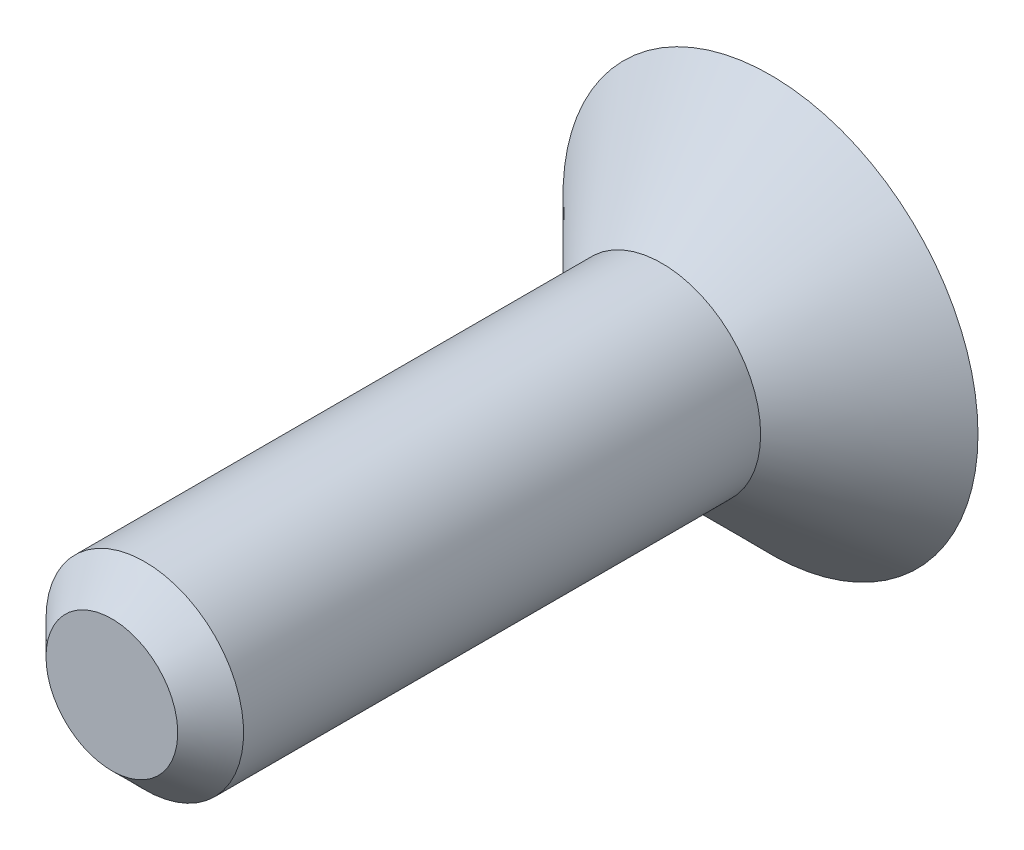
from build123d import *

# Parameters (mm, degrees)
ESQUISSE1_R     = 3.15
T_TE_DEPTH      = 2
T_TE_TAPER      = 45
ESQUISSE2_R     = 1.5
CORPS_DEPTH     = 10
EMPREINTE_DEPTH = 0.8
CHANFREIN_SIZE  = 0.5


with BuildPart() as part:
    # Esquisse1 → T_te (new body)
    with BuildSketch(Plane.XY):
        Circle(ESQUISSE1_R)
    extrude(amount=T_TE_DEPTH, taper=T_TE_TAPER)

    # Esquisse2 → Corps (add)
    with BuildSketch(Plane(origin=(0, 0, 0), x_dir=(-1, 0, 0), z_dir=(0, 0, -1))):
        Circle(ESQUISSE2_R)
    extrude(amount=-CORPS_DEPTH)

    # Esquisse3 → Empreinte (cut)
    with BuildSketch(Plane.XY):
        Polygon((-1.05, 1.818653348), (2.1, 0), (-1.05, -1.818653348), align=None)
    extrude(amount=EMPREINTE_DEPTH, mode=Mode.SUBTRACT)

    # Chanfrein
    chanfrein_edges = [part.edges().sort_by_distance(p)[0] for p in [
        (1.5, 0, 10),
    ]]
    chamfer(chanfrein_edges, length=CHANFREIN_SIZE)


solid = part.part
